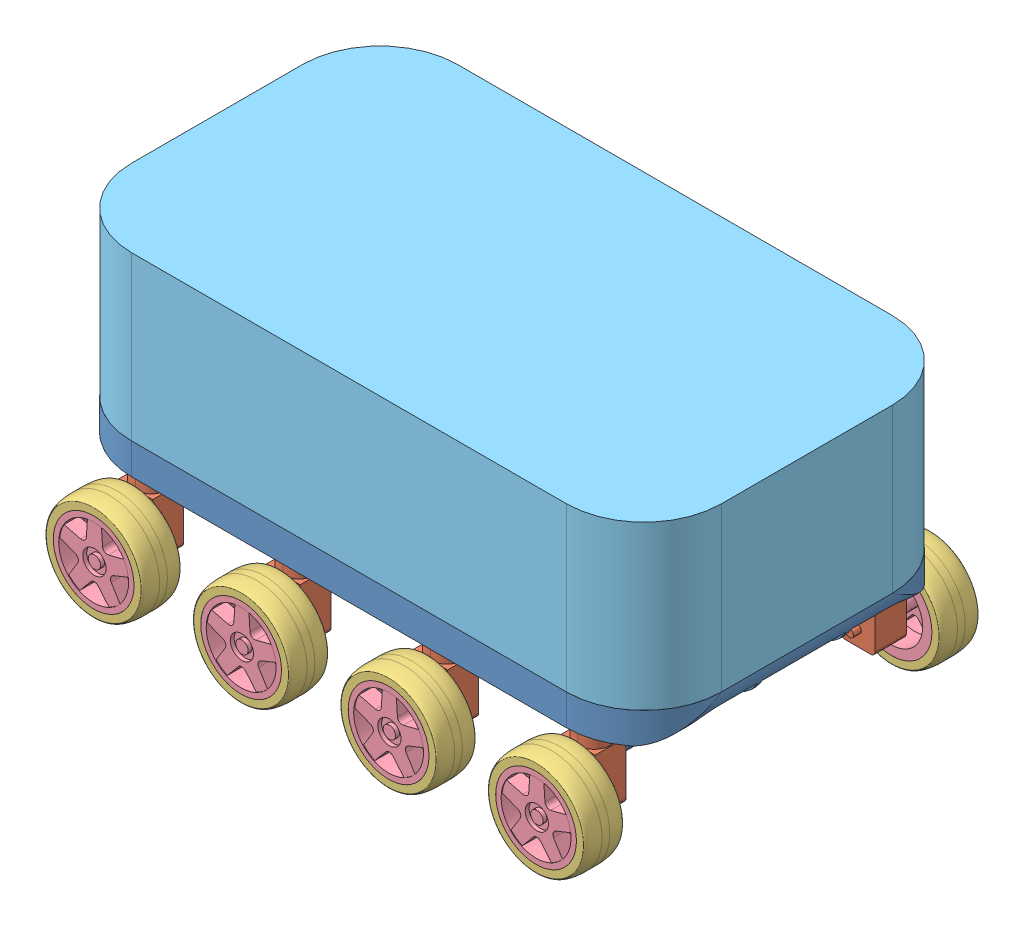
SolidWorks assembly Assem1.SLDASM, configuration Default (file format 15000). Lengths in mm.
Overall size (380 196.17 254.1).
26 component instances, 5 part files, 21 mates.
Components (placement in the parent):
- Main Frame-1: Main Frame.SLDPRT [Default] at (0 0 5) x (1 0 0) z (0 1 0) size (380 210 43.47)
- Motor and Gearbox-1: Motor and Gearbox.SLDPRT [Default] at (-156.5 -0.7359 95) x (0 1 0) z (0 0 1) size (67.23 22.5 30)
- Motor and Gearbox-2: Motor and Gearbox.SLDPRT [Default] at (-61.5 -0.7359 95) x (0 1 0) z (0 0 1) size (67.23 22.5 30)
- Motor and Gearbox-3: Motor and Gearbox.SLDPRT [Default] at (33.5 -0.7359 95) x (0 1 0) z (0 0 1) size (67.23 22.5 30)
- Motor and Gearbox-4: Motor and Gearbox.SLDPRT [Default] at (128.5 -0.7359 95) x (0 1 0) z (0 0 1) size (67.23 22.5 30)
- Tire-1: Tire.SLDPRT [Default] at (-78.8779 -48.7037 122) size (66.35 66.35 25.1)
- Tire-2: Tire.SLDPRT [Default] at (16.1221 -48.7037 122) size (66.35 66.35 25.1)
- Tire-3: Tire.SLDPRT [Default] at (111.1221 -48.7037 122) size (66.35 66.35 25.1)
- Tire-4: Tire.SLDPRT [Default] at (206.1221 -48.7037 122) size (66.35 66.35 25.1)
- Wheel-1: Wheel.SLDPRT [Default] at (-78.8779 -48.7037 97) size (52 52 30)
- Wheel-2: Wheel.SLDPRT [Default] at (16.1221 -48.7037 97) size (52 52 30)
- Wheel-3: Wheel.SLDPRT [Default] at (111.1221 -48.7037 97) size (52 52 30)
- Wheel-4: Wheel.SLDPRT [Default] at (206.1221 -48.7037 97) size (52 52 30)
- Wheel-5: Wheel.SLDPRT [Default] at (-206.1221 -46.7037 -107) x (-1 0 0) z (0 0 -1) size (52 52 30)
- Wheel-6: Wheel.SLDPRT [Default] at (-111.1221 -46.7037 -107) x (-1 0 0) z (0 0 -1) size (52 52 30)
- Wheel-7: Wheel.SLDPRT [Default] at (-16.1221 -46.7037 -107) x (-1 0 0) z (0 0 -1) size (52 52 30)
- Wheel-8: Wheel.SLDPRT [Default] at (78.8779 -46.7037 -107) x (-1 0 0) z (0 0 -1) size (52 52 30)
- Tire-5: Tire.SLDPRT [Default] at (-206.1221 -46.7037 -132) x (-1 0 0) z (0 0 -1) size (66.35 66.35 25.1)
- Tire-6: Tire.SLDPRT [Default] at (-111.1221 -46.7037 -132) x (-1 0 0) z (0 0 -1) size (66.35 66.35 25.1)
- Tire-7: Tire.SLDPRT [Default] at (-16.1221 -46.7037 -132) x (-1 0 0) z (0 0 -1) size (66.35 66.35 25.1)
- Tire-8: Tire.SLDPRT [Default] at (78.8779 -46.7037 -132) x (-1 0 0) z (0 0 -1) size (66.35 66.35 25.1)
- Motor and Gearbox-5: Motor and Gearbox.SLDPRT [Default] at (-128.5 1.2641 -105) x (0 1 0) z (0 0 -1) size (67.23 22.5 30)
- Motor and Gearbox-6: Motor and Gearbox.SLDPRT [Default] at (-33.5 1.2641 -105) x (0 1 0) z (0 0 -1) size (67.23 22.5 30)
- Motor and Gearbox-7: Motor and Gearbox.SLDPRT [Default] at (61.5 1.2641 -105) x (0 1 0) z (0 0 -1) size (67.23 22.5 30)
- Motor and Gearbox-8: Motor and Gearbox.SLDPRT [Default] at (156.5 1.2641 -105) x (0 1 0) z (0 0 -1) size (67.23 22.5 30)
- Main Casee-1: Main Casee.SLDPRT [Default] at (0 3 5) x (1 0 0) z (0 1 0) size (380 210 105)
Mates (geometry in assembly coordinates):
- Concentric1: concentric anti-aligned: cylinder of Main Frame-1 through (-133.5 -32 70) axis (0 0 1) radius 2; cylinder of Motor and Gearbox-1 through (-133.5 -32 100) axis (0 0 -1) radius 1.5
- Coincident4: coincident anti-aligned: plane of Main Frame-1 through (-190 3 75) normal (0 0 1); plane of Motor and Gearbox-1 through (-156.5 -0.7359 75) normal (0 0 -1)
- Concentric2: concentric anti-aligned: cylinder of Motor and Gearbox-1 through (-142.5 -55 100) axis (0 0 -1) radius 2.5; cylinder of Wheel-1 through (-142.5 -55 92) axis (0 0 1) radius 5
- Distance1: distance = 2 mm anti-aligned: plane of Wheel-1 through (-142.5 -55 97) normal (0 0 -1); plane of Motor and Gearbox-1 through (-156.5 -0.7359 95) normal (0 0 1)
- Coincident6: coincident aligned: plane of Tire-1 through (-142.5 -55 97) normal (0 0 -1); plane of Wheel-1 through (-142.5 -55 97) normal (0 0 -1)
- Concentric3: concentric aligned: cylinder of Tire-1 through (-142.5 -55 5.0761) axis (0 0 1) radius 26; cylinder of Wheel-1 through (-142.5 -55 3.6619) axis (0 0 1) radius 26
- Coincident7: coincident aligned: plane of Wheel-2 through (-47.5 -55 97) normal (0 0 -1); plane of Tire-2 through (-47.5 -55 97) normal (0 0 -1)
- Concentric4: concentric anti-aligned: cylinder of Wheel-2 through (-47.5 -55 92) axis (0 0 1) radius 5; cylinder of Motor and Gearbox-2 through (-47.5 -55 100) axis (0 0 -1) radius 2.5
- Concentric5: concentric aligned: cylinder of Wheel-2 through (-47.5 -55 3.6619) axis (0 0 1) radius 26; cylinder of Tire-2 through (-47.5 -55 5.0761) axis (0 0 1) radius 26
- Distance2: distance = 2 mm anti-aligned: plane of Wheel-2 through (-47.5 -55 97) normal (0 0 -1); plane of Motor and Gearbox-2 through (-61.5 -0.7359 95) normal (0 0 1)
- Concentric6: concentric anti-aligned: cylinder of Main Frame-1 through (-38.5 -32 70) axis (0 0 1) radius 2; cylinder of Motor and Gearbox-2 through (-38.5 -32 100) axis (0 0 -1) radius 1.5
- Concentric7: concentric aligned: cylinder of Tire-3 through (47.5 -55 5.0761) axis (0 0 1) radius 26; cylinder of Wheel-3 through (47.5 -55 3.6619) axis (0 0 1) radius 26
- Concentric8: concentric anti-aligned: cylinder of Motor and Gearbox-3 through (47.5 -55 100) axis (0 0 -1) radius 2.5; cylinder of Wheel-3 through (47.5 -55 92) axis (0 0 1) radius 5
- Distance3: distance = 2 mm anti-aligned: plane of Wheel-3 through (47.5 -55 97) normal (0 0 -1); plane of Motor and Gearbox-3 through (33.5 -0.7359 95) normal (0 0 1)
- Coincident8: coincident aligned: plane of Tire-3 through (47.5 -55 97) normal (0 0 -1); plane of Wheel-3 through (47.5 -55 97) normal (0 0 -1)
- Concentric9: concentric anti-aligned: cylinder of Main Frame-1 through (38.5 -32 70) axis (0 0 1) radius 2; cylinder of Motor and Gearbox-3 through (38.5 -32 100) axis (0 0 -1) radius 1.5
- Concentric10: concentric anti-aligned: cylinder of Wheel-4 through (142.5 -55 92) axis (0 0 1) radius 5; cylinder of Motor and Gearbox-4 through (142.5 -55 100) axis (0 0 -1) radius 2.5
- Distance4: distance = 2 mm anti-aligned: plane of Wheel-4 through (142.5 -55 97) normal (0 0 -1); plane of Motor and Gearbox-4 through (128.5 -0.7359 95) normal (0 0 1)
- Concentric11: concentric aligned: cylinder of Wheel-4 through (142.5 -55 3.6619) axis (0 0 1) radius 26; cylinder of Tire-4 through (142.5 -55 5.0761) axis (0 0 1) radius 26
- Coincident9: coincident aligned: plane of Wheel-4 through (142.5 -55 97) normal (0 0 -1); plane of Tire-4 through (142.5 -55 97) normal (0 0 -1)
- Concentric12: concentric anti-aligned: cylinder of Main Frame-1 through (133.5 -32 70) axis (0 0 1) radius 2; cylinder of Motor and Gearbox-4 through (133.5 -32 100) axis (0 0 -1) radius 1.5
